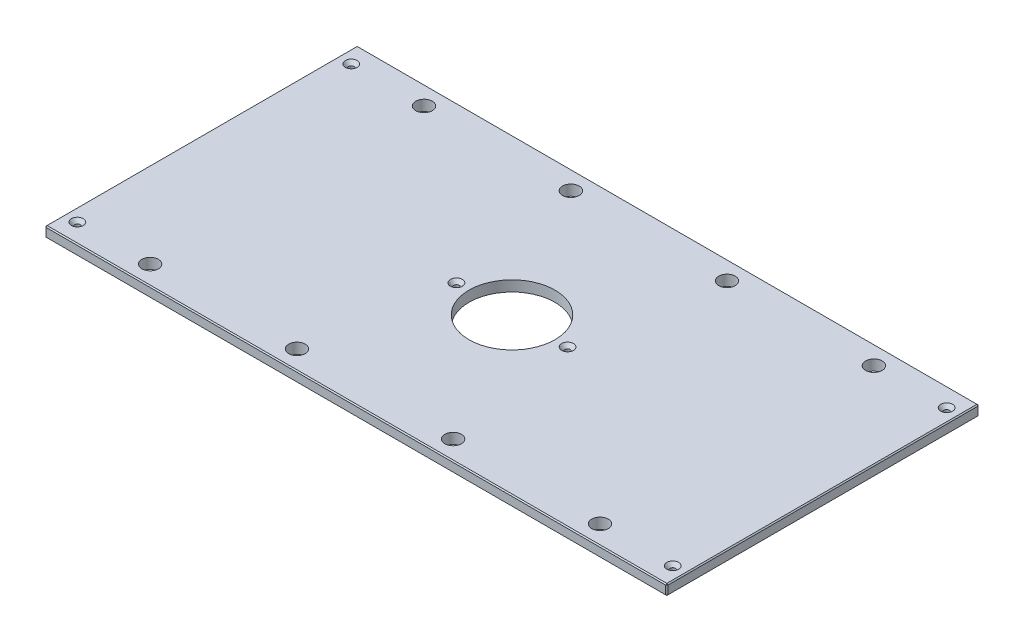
from build123d import *

# Parameters (mm, degrees)
SKETCH1_W                                        = 746.125
SKETCH1_H                                        = 374.65
BOSS_EXTRUDE1_DEPTH                              = 12.7
SKETCH13_R                                       = 51.562
CUT_EXTRUDE6_DEPTH                               = 418.645273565
F_25_32_0_78125_DIAMETER_HOLE1_D                 = 19.84375
CHAMFER2_SIZE                                    = 1.27
CSK_FOR_1_4_FLAT_HEAD_MACHINE_SCREW1_D           = 6.7564
CSK_FOR_1_4_FLAT_HEAD_MACHINE_SCREW1_CSINK_D     = 14.2748
CSK_FOR_1_4_FLAT_HEAD_MACHINE_SCREW1_CSINK_ANGLE = 82


with BuildPart() as part:
    # Sketch1 → Boss-Extrude1 (new body)
    with BuildSketch(Plane(origin=(0, 0, 0), x_dir=(1, 0, 0), z_dir=(0, 1, 0))):
        Rectangle(SKETCH1_W, SKETCH1_H)
    extrude(amount=BOSS_EXTRUDE1_DEPTH)

    # Sketch13 → Cut-Extrude6 (cut, through all)
    with BuildSketch(Plane(origin=(0, 12.7, 0), x_dir=(1, 0, 0), z_dir=(0, 1, 0))):
        with Locations(Location((0, 0, 0), (0, 0, 270))):
            Circle(SKETCH13_R)
    extrude(amount=-CUT_EXTRUDE6_DEPTH, mode=Mode.SUBTRACT)

    # 25_32 _0.78125_ Diameter Hole1 (through all)
    with Locations(Plane(origin=(0, 12.7, 0), x_dir=(1, 0, 0), z_dir=(0, 1, 0))):
        with Locations((269.875, 164.30498), (-269.875, 164.30498), (269.875, -164.30498), (-269.875, -164.30498), (-93.6625, 164.30498), (93.6625, 164.30498), (93.6625, -164.30498), (-93.6625, -164.30498)):
            Hole(F_25_32_0_78125_DIAMETER_HOLE1_D / 2)

    # Chamfer2
    chamfer2_edges = [part.edges().sort_by_distance(p)[0] for p in [
        (373.0625, 12.7, 0),
        (0, 12.7, -187.325),
        (-373.0625, 12.7, 0),
        (0, 0, -187.325),
        (373.0625, 0, 0),
        (0, 0, 187.325),
        (-373.0625, 0, 0),
        (0, 12.7, 187.325),
        (-373.0625, 6.35, -187.325),
        (373.0625, 6.35, -187.325),
        (373.0625, 6.35, 187.325),
        (-373.0625, 6.35, 187.325),
    ]]
    chamfer(chamfer2_edges, length=CHAMFER2_SIZE)

    # CSK for 1_4 Flat Head Machine Screw1 (through all)
    with Locations(Plane(origin=(0, 12.7, 0), x_dir=(1, 0, 0), z_dir=(0, 1, 0))):
        with Locations((357.1875, 164.30498), (357.1875, -164.30498), (-357.1875, -164.30498), (-66.675, 0), (66.675, 0), (-357.1875, 164.30498), (-269.875, 164.30498), (-269.875, -164.30498)):
            CounterSinkHole(CSK_FOR_1_4_FLAT_HEAD_MACHINE_SCREW1_D / 2, CSK_FOR_1_4_FLAT_HEAD_MACHINE_SCREW1_CSINK_D / 2, counter_sink_angle=CSK_FOR_1_4_FLAT_HEAD_MACHINE_SCREW1_CSINK_ANGLE)


solid = part.part
